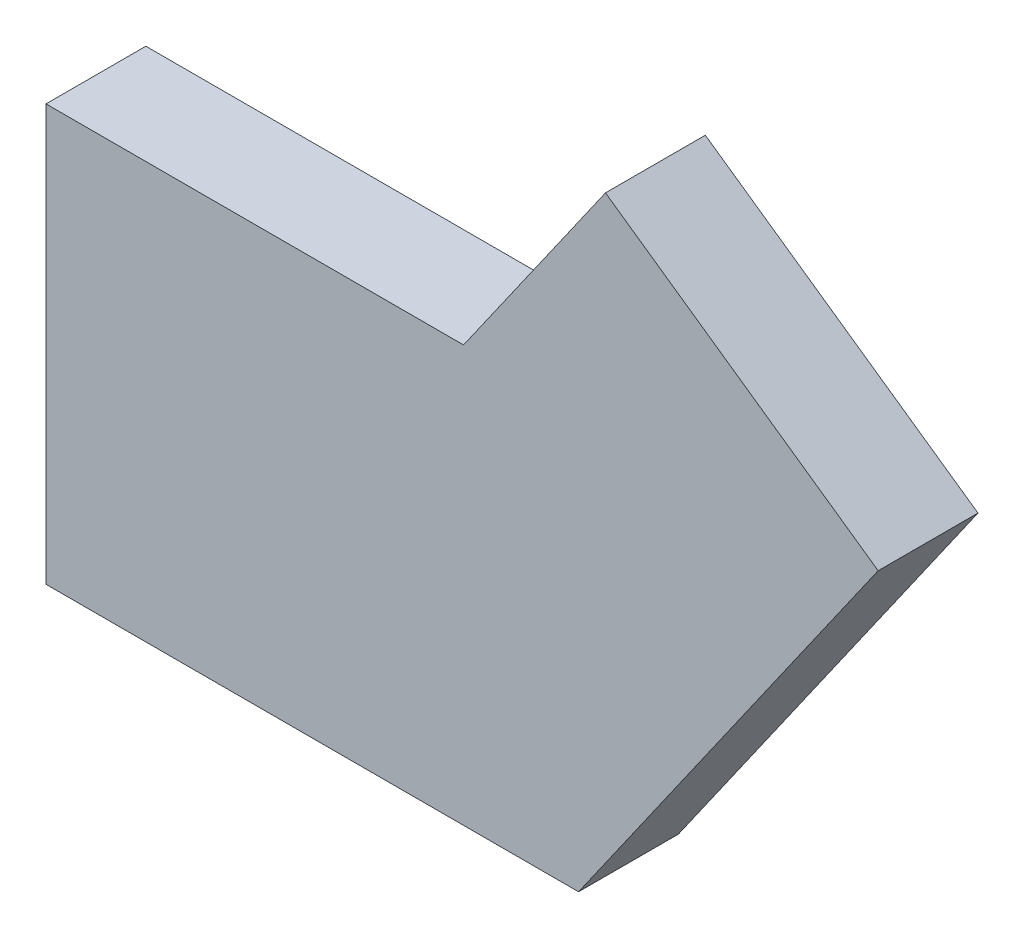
from build123d import *

# Parameters (mm, degrees)
BOSS_EXTRUDE1_DEPTH = 6


with BuildPart() as part:
    # Sketch1 → Boss-Extrude1 (new body)
    with BuildSketch(Plane.XY):
        Polygon((0, 0), (32, 0), (50, 25.706664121), (33.616959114, 37.178192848), (25.08969668, 25), (0, 25), align=None)
    extrude(amount=BOSS_EXTRUDE1_DEPTH)


solid = part.part
